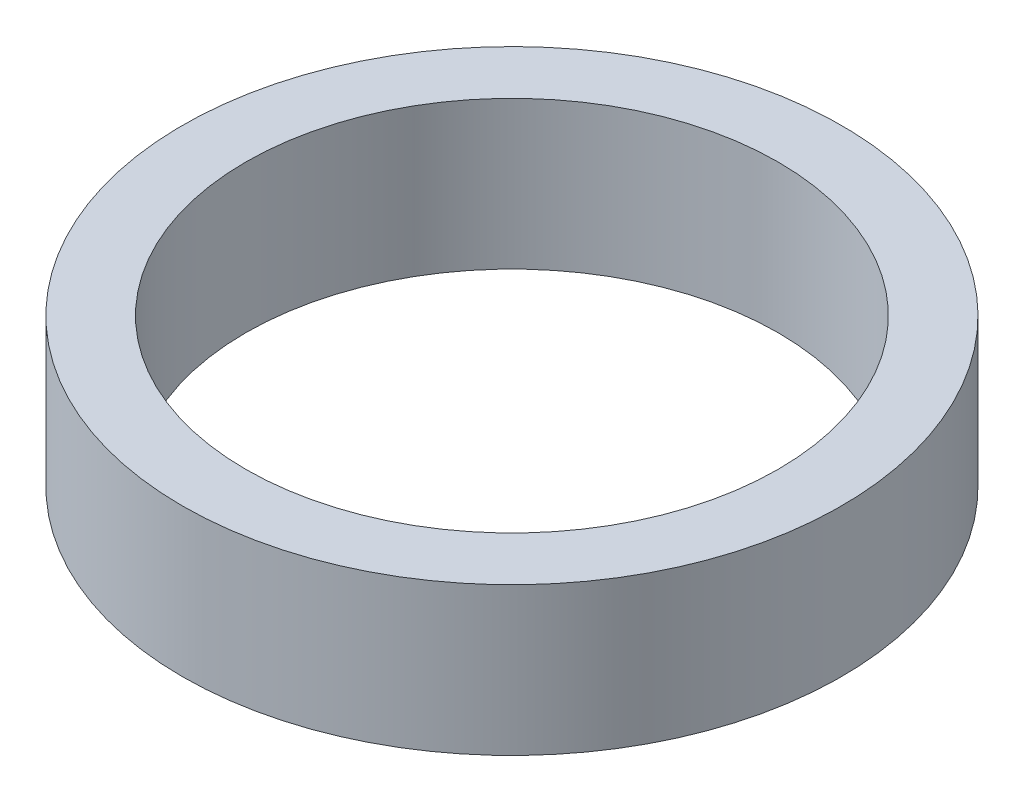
ISO-10303-21;
HEADER;
FILE_DESCRIPTION(('STEP AP214'),'2;1');
FILE_NAME('part.step','',(''),(''),'','','');
FILE_SCHEMA(('AUTOMOTIVE_DESIGN { 1 0 10303 214 1 1 1 1 }'));
ENDSEC;
DATA;
#1=APPLICATION_CONTEXT('core data for automotive mechanical design processes');
#2=APPLICATION_PROTOCOL_DEFINITION('international standard','automotive_design',2000,#1);
#3=PRODUCT_CONTEXT('',#1,'mechanical');
#4=PRODUCT('Part','Part','',(#3));
#5=PRODUCT_RELATED_PRODUCT_CATEGORY('part','',(#4));
#6=PRODUCT_DEFINITION_FORMATION('','',#4);
#7=PRODUCT_DEFINITION_CONTEXT('part definition',#1,'design');
#8=PRODUCT_DEFINITION('design','',#6,#7);
#9=PRODUCT_DEFINITION_SHAPE('','',#8);
#10=(LENGTH_UNIT() NAMED_UNIT(*) SI_UNIT(.MILLI.,.METRE.));
#11=(NAMED_UNIT(*) PLANE_ANGLE_UNIT() SI_UNIT($,.RADIAN.));
#12=(NAMED_UNIT(*) SI_UNIT($,.STERADIAN.) SOLID_ANGLE_UNIT());
#13=UNCERTAINTY_MEASURE_WITH_UNIT(LENGTH_MEASURE(1.E-05),#10,'distance_accuracy_value','');
#14=(GEOMETRIC_REPRESENTATION_CONTEXT(3) GLOBAL_UNCERTAINTY_ASSIGNED_CONTEXT((#13)) GLOBAL_UNIT_ASSIGNED_CONTEXT((#10,
#11,#12)) REPRESENTATION_CONTEXT('',''));
#15=CARTESIAN_POINT('',(0.,0.,0.));
#16=DIRECTION('',(0.,0.,1.));
#17=DIRECTION('',(1.,0.,0.));
#18=AXIS2_PLACEMENT_3D('',#15,#16,#17);
#19=CARTESIAN_POINT('',(0.,7.,0.));
#20=DIRECTION('',(0.,1.,0.));
#21=DIRECTION('',(0.,0.,1.));
#22=AXIS2_PLACEMENT_3D('',#19,#20,#21);
#23=PLANE('',#22);
#24=CARTESIAN_POINT('',(0.,7.,0.));
#25=DIRECTION('',(0.,1.,0.));
#26=DIRECTION('',(0.,0.,1.));
#27=AXIS2_PLACEMENT_3D('',#24,#25,#26);
#28=CIRCLE('',#27,15.6);
#29=CARTESIAN_POINT('',(0.,7.,15.6));
#30=VERTEX_POINT('',#29);
#31=EDGE_CURVE('E10',#30,#30,#28,.T.);
#32=ORIENTED_EDGE('',*,*,#31,.T.);
#33=EDGE_LOOP('',(#32));
#34=FACE_BOUND('',#33,.T.);
#35=CARTESIAN_POINT('',(0.,7.,0.));
#36=DIRECTION('',(0.,1.,0.));
#37=DIRECTION('',(0.,0.,1.));
#38=AXIS2_PLACEMENT_3D('',#35,#36,#37);
#39=CIRCLE('',#38,12.6);
#40=CARTESIAN_POINT('',(0.,7.,12.6));
#41=VERTEX_POINT('',#40);
#42=EDGE_CURVE('E41',#41,#41,#39,.T.);
#43=ORIENTED_EDGE('',*,*,#42,.F.);
#44=EDGE_LOOP('',(#43));
#45=FACE_BOUND('',#44,.T.);
#46=ADVANCED_FACE('F30',(#34,#45),#23,.T.);
#47=CARTESIAN_POINT('',(0.,0.,0.));
#48=DIRECTION('',(0.,1.,0.));
#49=DIRECTION('',(0.,0.,1.));
#50=AXIS2_PLACEMENT_3D('',#47,#48,#49);
#51=PLANE('',#50);
#52=CARTESIAN_POINT('',(0.,0.,0.));
#53=DIRECTION('',(0.,1.,0.));
#54=DIRECTION('',(0.,0.,1.));
#55=AXIS2_PLACEMENT_3D('',#52,#53,#54);
#56=CIRCLE('',#55,15.6);
#57=CARTESIAN_POINT('',(0.,0.,15.6));
#58=VERTEX_POINT('',#57);
#59=EDGE_CURVE('E34',#58,#58,#56,.T.);
#60=ORIENTED_EDGE('',*,*,#59,.F.);
#61=EDGE_LOOP('',(#60));
#62=FACE_BOUND('',#61,.T.);
#63=CARTESIAN_POINT('',(0.,0.,0.));
#64=DIRECTION('',(0.,1.,0.));
#65=DIRECTION('',(0.,0.,1.));
#66=AXIS2_PLACEMENT_3D('',#63,#64,#65);
#67=CIRCLE('',#66,12.6);
#68=CARTESIAN_POINT('',(0.,0.,12.6));
#69=VERTEX_POINT('',#68);
#70=EDGE_CURVE('E43',#69,#69,#67,.T.);
#71=ORIENTED_EDGE('',*,*,#70,.T.);
#72=EDGE_LOOP('',(#71));
#73=FACE_BOUND('',#72,.T.);
#74=ADVANCED_FACE('F53',(#62,#73),#51,.F.);
#75=CARTESIAN_POINT('',(0.,7.,0.));
#76=DIRECTION('',(0.,-1.,0.));
#77=DIRECTION('',(0.,0.,-1.));
#78=AXIS2_PLACEMENT_3D('',#75,#76,#77);
#79=CYLINDRICAL_SURFACE('',#78,15.6);
#80=ORIENTED_EDGE('',*,*,#31,.F.);
#81=EDGE_LOOP('',(#80));
#82=FACE_BOUND('',#81,.T.);
#83=ORIENTED_EDGE('',*,*,#59,.T.);
#84=EDGE_LOOP('',(#83));
#85=FACE_BOUND('',#84,.T.);
#86=ADVANCED_FACE('F32',(#82,#85),#79,.T.);
#87=CARTESIAN_POINT('',(0.,7.,0.));
#88=DIRECTION('',(0.,-1.,0.));
#89=DIRECTION('',(0.,0.,-1.));
#90=AXIS2_PLACEMENT_3D('',#87,#88,#89);
#91=CYLINDRICAL_SURFACE('',#90,12.6);
#92=ORIENTED_EDGE('',*,*,#42,.T.);
#93=EDGE_LOOP('',(#92));
#94=FACE_BOUND('',#93,.T.);
#95=ORIENTED_EDGE('',*,*,#70,.F.);
#96=EDGE_LOOP('',(#95));
#97=FACE_BOUND('',#96,.T.);
#98=ADVANCED_FACE('F49',(#94,#97),#91,.F.);
#99=CLOSED_SHELL('',(#46,#74,#86,#98));
#100=MANIFOLD_SOLID_BREP('B2',#99);
#101=ADVANCED_BREP_SHAPE_REPRESENTATION('',(#18,#100),#14);
#102=SHAPE_DEFINITION_REPRESENTATION(#9,#101);
ENDSEC;
END-ISO-10303-21;
